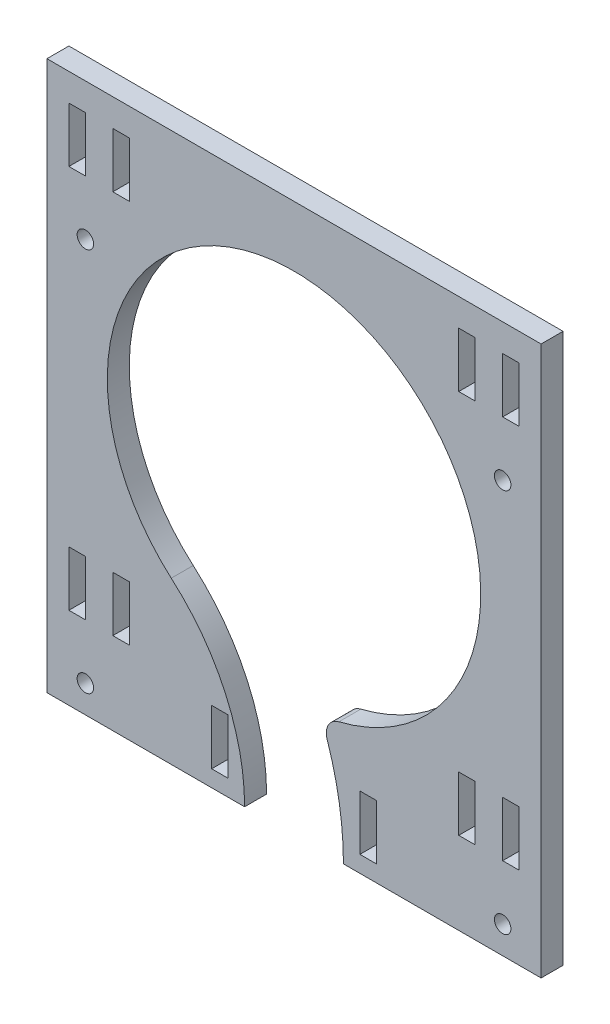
from build123d import *

# Parameters (mm, degrees)
EXTRUDE_2_DEPTH     = 4
SKETCH_5_W          = 3
SKETCH_5_H          = 10
CUT_EXTRUDE_2_DEPTH = 72.175838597
SKETCH_6_R          = 1.5
SKETCH_6_W          = 3
SKETCH_6_H          = 10
CUT_EXTRUDE_3_DEPTH = 10
FILLET_1_R          = 3


with BuildPart() as part:
    # Sketch 3 → Extrude 2 (new body)
    with BuildSketch(Plane.XY):
        with BuildLine():
            Line((45, 45), (-45, 45))
            Line((-45, 45), (-45, -45))
            Line((-45, -45), (-45, -55))
            Line((-45, -55), (-9, -55))
            ThreePointArc((-9, -55), (-12.495707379, -38.861685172), (-22.356164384, -25.616438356))
            ThreePointArc((-22.356164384, -25.616438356), (9.630547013, 32.607553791), (4.851370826, -33.652105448))
            ThreePointArc((4.851370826, -33.652105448), (7.953231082, -44.126365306), (9, -55))
            Line((9, -55), (45, -55))
            Line((45, -55), (45, -45))
            Line((45, -45), (45, 45))
        make_face()
    extrude(amount=EXTRUDE_2_DEPTH)

    # Sketch 5 → Cut-Extrude 2 (cut, through all)
    with BuildSketch(Plane.XY.offset(4)):
        with Locations((-31.5, 35)):
            Rectangle(SKETCH_5_W, SKETCH_5_H)
        with Locations((31.5, 35)):
            Rectangle(SKETCH_5_W, SKETCH_5_H)
        with Locations((-31.5, -35)):
            Rectangle(SKETCH_5_W, SKETCH_5_H)
        with Locations((31.5, -35)):
            Rectangle(SKETCH_5_W, SKETCH_5_H)
    extrude(amount=-CUT_EXTRUDE_2_DEPTH, mode=Mode.SUBTRACT)

    # Sketch 6 → Cut-Extrude 3 (cut)
    with BuildSketch(Plane.XY.offset(4)):
        with Locations((-38, -50)):
            Circle(SKETCH_6_R)
        with Locations((-38, 20)):
            Circle(SKETCH_6_R)
        with Locations((38, 20)):
            Circle(SKETCH_6_R)
        with Locations((38, -50)):
            Circle(SKETCH_6_R)
        with Locations((-39.5, -35)):
            Rectangle(SKETCH_6_W, SKETCH_6_H)
        with Locations((-39.5, 35)):
            Rectangle(SKETCH_6_W, SKETCH_6_H)
        with Locations((-13.5, -47)):
            Rectangle(SKETCH_6_W, SKETCH_6_H)
        with Locations((13.5, -47)):
            Rectangle(SKETCH_6_W, SKETCH_6_H)
        with Locations((39.5, 35)):
            Rectangle(SKETCH_6_W, SKETCH_6_H)
        with Locations((39.5, -35)):
            Rectangle(SKETCH_6_W, SKETCH_6_H)
    extrude(amount=-CUT_EXTRUDE_3_DEPTH, mode=Mode.SUBTRACT)

    # Fillet 1
    fillet_1_edges = [part.edges().sort_by_distance(p)[0] for p in [
        (4.851370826, -33.652105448, 2),
    ]]
    fillet(fillet_1_edges, radius=FILLET_1_R)


solid = part.part
